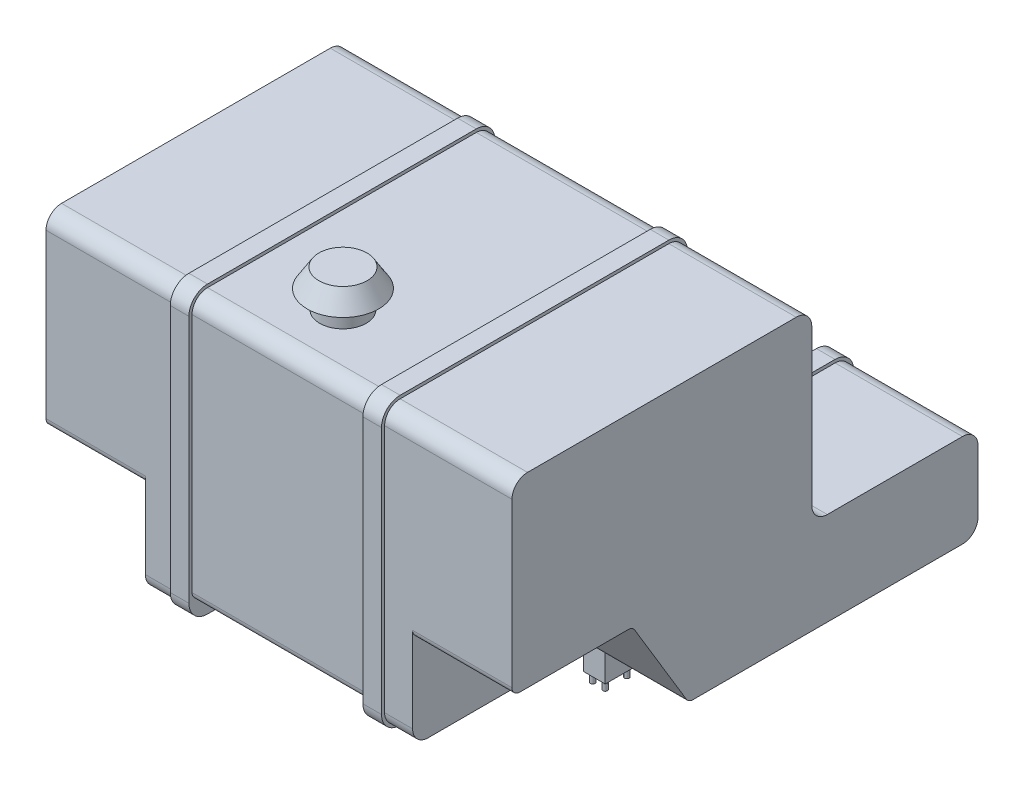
from build123d import *

# Parameters (mm, degrees)
SKETCH1_W             = 70
SKETCH1_H             = 100
BOSS_EXTRUDE1_DEPTH   = 145
BOSS_EXTRUDE1_2_DEPTH = 145
BOSS_EXTRUDE1_3_DEPTH = 145
BOSS_EXTRUDE1_4_DEPTH = 145
SKETCH1_3_R           = 7.5
BOSS_EXTRUDE2_DEPTH   = 30
SKETCH3_W             = 1500
SKETCH3_H             = 1500
BOSS_EXTRUDE3_DEPTH   = 300
SKETCH4_W             = 1500
SKETCH4_H             = 965
BOSS_EXTRUDE4_DEPTH   = 600
FILLET1_R             = 50
SKETCH5_R             = 75
BOSS_EXTRUDE5_DEPTH   = 60
SKETCH6_R             = 115
BOSS_EXTRUDE6_DEPTH   = 60
BOSS_EXTRUDE6_TAPER   = 32
CUT_EXTRUDE4_DEPTH    = 320
BOSS_EXTRUDE8_START   = -410
BOSS_EXTRUDE8_DEPTH   = 60
SKETCH12_W            = 560
SKETCH12_H            = 74.377458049
CUT_EXTRUDE5_DEPTH    = 257
FILLET4_R             = 25
SKETCH13_W            = 560
SKETCH13_H            = 50
CUT_EXTRUDE6_DEPTH    = 2050.347457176
FILLET5_R             = 25


with BuildPart() as part:
    # Sketch1 → Boss-Extrude1 (new body)
    with BuildSketch(Plane(origin=(0, 0, 0), x_dir=(1, 0, 0), z_dir=(0, 1, 0))):
        with Locations((-385, 285)):
            Rectangle(SKETCH1_W, SKETCH1_H)
    extrude(amount=BOSS_EXTRUDE1_DEPTH)



with BuildPart() as body_2:
    # Sketch1 → Boss-Extrude1 2 (new body)
    with BuildSketch(Plane(origin=(0, 0, 0), x_dir=(1, 0, 0), z_dir=(0, 1, 0))):
        with Locations((385, 285)):
            Rectangle(SKETCH1_W, SKETCH1_H)
    extrude(amount=BOSS_EXTRUDE1_2_DEPTH)


with BuildPart() as body_3:
    # Sketch1 → Boss-Extrude1 3 (new body)
    with BuildSketch(Plane(origin=(0, 0, 0), x_dir=(1, 0, 0), z_dir=(0, 1, 0))):
        with Locations((-385, -285)):
            Rectangle(SKETCH1_W, SKETCH1_H)
    extrude(amount=BOSS_EXTRUDE1_3_DEPTH)


with BuildPart() as body_4:
    # Sketch1 → Boss-Extrude1 4 (new body)
    with BuildSketch(Plane(origin=(0, 0, 0), x_dir=(1, 0, 0), z_dir=(0, 1, 0))):
        with Locations((385, -285)):
            Rectangle(SKETCH1_W, SKETCH1_H)
    extrude(amount=BOSS_EXTRUDE1_4_DEPTH)


with BuildPart() as part_1:
    add(part.part)

    add(body_2.part)  # Boss-Extrude2 merges body 2

    add(body_3.part)  # Boss-Extrude2 merges body 3

    add(body_4.part)  # Boss-Extrude2 merges body 4
    # Sketch1_3 → Boss-Extrude2 (add)
    with BuildSketch(Plane(origin=(0, 0, 0), x_dir=(1, 0, 0), z_dir=(0, 1, 0))):
        with BuildLine():
            Line((365, 257.5), (365, 250))
            Line((365, 250), (372.5, 250))
            ThreePointArc((372.5, 250), (370.303300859, 255.303300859), (365, 257.5))
        make_face()
        with BuildLine():
            Line((372.5, 250), (365, 250))
            Line((365, 250), (365, 257.5))
            ThreePointArc((365, 257.5), (359.696699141, 244.696699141), (372.5, 250))
        make_face()
        with BuildLine():
            Line((365, 257.5), (365, 250))
            Line((365, 250), (372.5, 250))
            ThreePointArc((372.5, 250), (370.303300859, 255.303300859), (365, 257.5))
        make_face()
        with BuildLine():
            Line((372.5, 250), (365, 250))
            Line((365, 250), (365, 257.5))
            ThreePointArc((365, 257.5), (359.696699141, 244.696699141), (372.5, 250))
        make_face()
        with Locations(Location((-405, 320, 0), (0, 0, 270))):
            Circle(SKETCH1_3_R)
        with Locations(Location((-405, 250, 0), (0, 0, 270))):
            Circle(SKETCH1_3_R)
        with Locations(Location((-365, 250, 0), (0, 0, 270))):
            Circle(SKETCH1_3_R)
        with Locations(Location((-365, 320, 0), (0, 0, 270))):
            Circle(SKETCH1_3_R)
        with Locations(Location((-405, -320, 0), (0, 0, 270))):
            Circle(SKETCH1_3_R)
        with Locations(Location((-405, -250, 0), (0, 0, 270))):
            Circle(SKETCH1_3_R)
        with Locations(Location((-365, -250, 0), (0, 0, 270))):
            Circle(SKETCH1_3_R)
        with Locations(Location((-365, -320, 0), (0, 0, 270))):
            Circle(SKETCH1_3_R)
        with Locations(Location((365, -320, 0), (0, 0, 270))):
            Circle(SKETCH1_3_R)
        with Locations(Location((405, -320, 0), (0, 0, 270))):
            Circle(SKETCH1_3_R)
        with Locations(Location((365, -250, 0), (0, 0, 270))):
            Circle(SKETCH1_3_R)
        with Locations(Location((405, -250, 0), (0, 0, 270))):
            Circle(SKETCH1_3_R)
        with Locations(Location((365, 320, 0), (0, 0, 270))):
            Circle(SKETCH1_3_R)
        with Locations(Location((405, 250, 0), (0, 0, 270))):
            Circle(SKETCH1_3_R)
        with Locations(Location((405, 320, 0), (0, 0, 270))):
            Circle(SKETCH1_3_R)
    extrude(amount=-BOSS_EXTRUDE2_DEPTH)

    # Sketch3 → Boss-Extrude3 (add)
    with BuildSketch(Plane(origin=(0, 145, 0), x_dir=(1, 0, 0), z_dir=(0, 1, 0))):
        with Locations((0, -215)):
            Rectangle(SKETCH3_W, SKETCH3_H)
    extrude(amount=BOSS_EXTRUDE3_DEPTH)

    # Sketch4 → Boss-Extrude4 (add)
    with BuildSketch(Plane(origin=(0, 445, 0), x_dir=(1, 0, 0), z_dir=(0, 1, 0))):
        with Locations((0, -482.5)):
            Rectangle(SKETCH4_W, SKETCH4_H)
    extrude(amount=BOSS_EXTRUDE4_DEPTH)

    # Fillet1
    fillet1_edges = [part_1.edges().sort_by_distance(p)[0] for p in [
        (0, 445, 0),
        (0, 1045, 965),
        (0, 1045, 0),
        (0, 145, -535),
        (0, 145, 965),
        (0, 445, -535),
    ]]
    fillet(fillet1_edges, radius=FILLET1_R)

    # Sketch5 → Boss-Extrude5 (add)
    with BuildSketch(Plane(origin=(0, 1045, 0), x_dir=(1, 0, 0), z_dir=(0, 1, 0))):
        with Locations(Location((0, -759.137260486, 0), (0, 0, 90))):
            Circle(SKETCH5_R)
    extrude(amount=BOSS_EXTRUDE5_DEPTH)

    # Sketch6 → Boss-Extrude6 (add)
    with BuildSketch(Plane(origin=(0, 1105, 0), x_dir=(1, 0, 0), z_dir=(0, 1, 0))):
        with Locations((0, -759.137260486)):
            Circle(SKETCH6_R)
    extrude(amount=BOSS_EXTRUDE6_DEPTH, taper=BOSS_EXTRUDE6_TAPER)

    # Sketch11 → Cut-Extrude4 (cut)
    with BuildSketch(Plane(origin=(750, 0, 0), x_dir=(0, 0, -1), z_dir=(1, 0, 0))):
        with BuildLine():
            Line((-965, 444.762104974), (-577.048767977, 444.762104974))
            Line((-577.048767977, 444.762104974), (-396.584830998, 145))
            Line((-396.584830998, 145), (-915, 145))
            ThreePointArc((-915, 145), (-950.355339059, 159.644660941), (-965, 195))
            Line((-965, 195), (-965, 444.762104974))
        make_face()
    cut_extrude4 = extrude(amount=-CUT_EXTRUDE4_DEPTH, mode=Mode.SUBTRACT)

    # Mirror3: Cut-Extrude4 across plane
    add(cut_extrude4.mirror(Plane(origin=(0, 0, 0), x_dir=(0, 0, 1), z_dir=(1, 0, 0))), mode=Mode.SUBTRACT)

    # Sketch7 → Boss-Extrude8 (add)
    with BuildSketch(Plane(origin=(750, 0, 0), x_dir=(0, 0, -1), z_dir=(1, 0, 0)).offset(BOSS_EXTRUDE8_START)):
        with BuildLine():
            Line((-50, 1055), (-915, 1055))
            ThreePointArc((-915, 1055), (-957.426406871, 1037.426406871), (-975, 995))
            Line((-975, 995), (-975, 195))
            ThreePointArc((-975, 195), (-957.426406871, 152.573593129), (-915, 135))
            Line((-915, 135), (485, 135))
            ThreePointArc((485, 135), (527.426406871, 152.573593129), (545, 195))
            Line((545, 195), (545, 395))
            ThreePointArc((545, 395), (527.426406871, 437.426406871), (485, 455))
            Line((485, 455), (50, 455))
            ThreePointArc((50, 455), (21.715728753, 466.715728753), (10, 495))
            Line((10, 495), (10, 995))
            ThreePointArc((10, 995), (-7.573593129, 1037.426406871), (-50, 1055))
        make_face()
    boss_extrude8 = extrude(amount=-BOSS_EXTRUDE8_DEPTH)

    # Mirror4: Boss-Extrude8 across plane
    add(boss_extrude8.mirror(Plane(origin=(0, 0, 0), x_dir=(0, 0, 1), z_dir=(1, 0, 0))))

    # Sketch12 → Cut-Extrude5 (cut)
    with BuildSketch(Plane(origin=(0, 0, -535), x_dir=(-1, 0, 0), z_dir=(0, 0, -1))):
        with Locations((0, 407.811270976)):
            Rectangle(SKETCH12_W, SKETCH12_H)
    extrude(amount=-CUT_EXTRUDE5_DEPTH, mode=Mode.SUBTRACT)

    # Fillet4
    fillet4_edges = [part_1.edges().sort_by_distance(p)[0] for p in [
        (0, 445, -278),
        (0, 370.622541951, -278),
        (0, 370.622541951, -535),
    ]]
    fillet(fillet4_edges, radius=FILLET4_R)

    # Sketch13 → Cut-Extrude6 (cut, through all)
    with BuildSketch(Plane(origin=(0, 0, -535), x_dir=(-1, 0, 0), z_dir=(0, 0, -1))):
        with Locations((0, 170)):
            Rectangle(SKETCH13_W, SKETCH13_H)
    extrude(amount=-CUT_EXTRUDE6_DEPTH, mode=Mode.SUBTRACT)

    # Fillet5
    fillet5_edges = [part_1.edges().sort_by_distance(p)[0] for p in [
        (590, 444.762104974, 965),
        (590, 444.762104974, 577.048767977),
        (590, 145, 396.584830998),
        (-590, 444.762104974, 965),
        (-590, 145, 396.584830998),
        (-590, 444.762104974, 577.048767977),
        (0, 195, -535),
        (0, 195, 965),
    ]]
    fillet(fillet5_edges, radius=FILLET5_R)


solid = part_1.part
